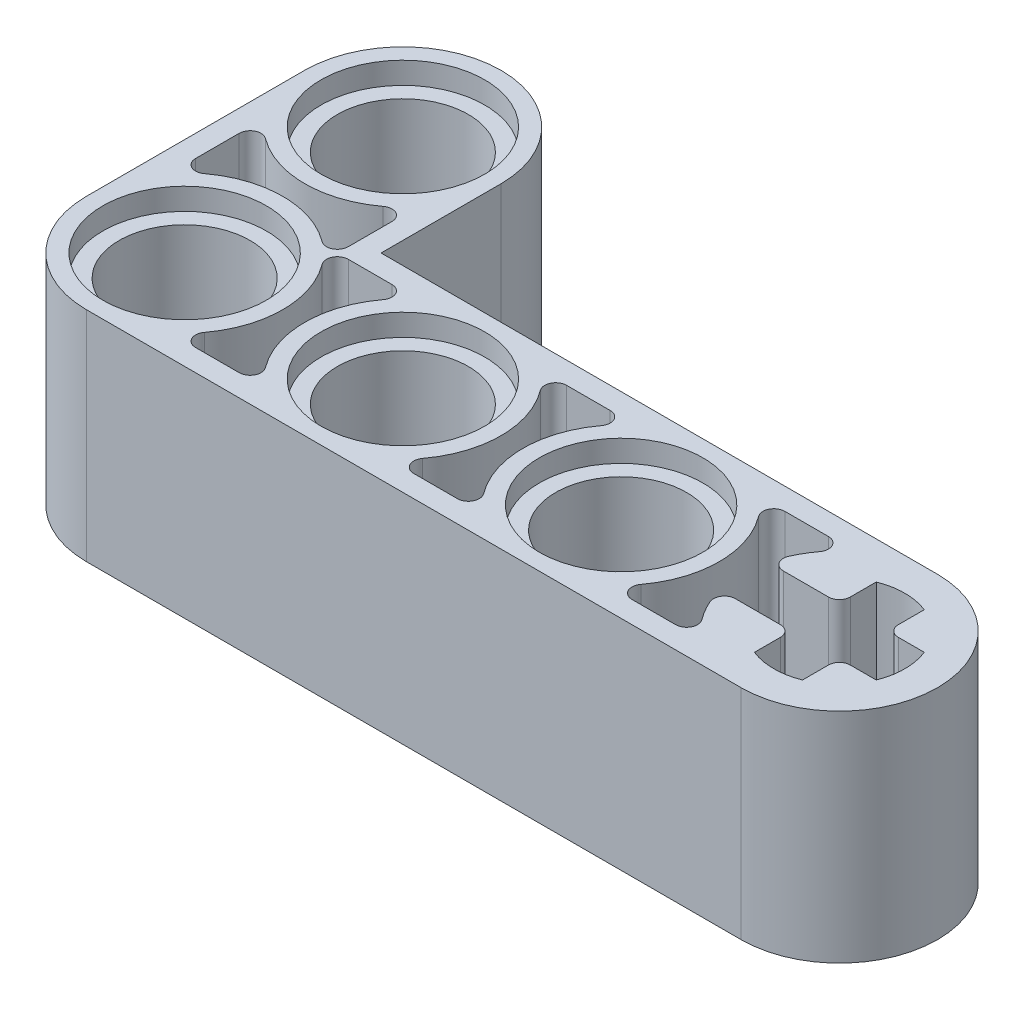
from build123d import *

# Parameters (mm, degrees)
BOSS_EXTRUDE1_DEPTH      = 4
BOSS_EXTRUDE1_DEPTH_BACK = 4
SKETCH1_R                = 2.4
SKETCH2_R                = 3
CUT_EXTRUDE1_DEPTH       = 0.8
CUT_EXTRUDE2_START       = -3.2
CUT_EXTRUDE2_DEPTH       = 3.2
CUT_EXTRUDE3_DEPTH       = 22.02189335


with BuildPart() as part:
    # Sketch1 → Boss-Extrude1 (new, two sides: drawn at the far end of the back side and taken through both)
    with BuildSketch(Plane(origin=(0, 0, 0), x_dir=(1, 0, 0), z_dir=(0, 1, 0)).offset(-BOSS_EXTRUDE1_DEPTH_BACK)):
        with BuildLine():
            Line((12, 3.6), (-8.4, 3.6))
            Line((-8.4, 3.6), (-8.4, 8))
            ThreePointArc((-8.4, 8), (-12, 11.6), (-15.6, 8))
            Line((-15.6, 8), (-15.6, 0))
            ThreePointArc((-15.6, 0), (-14.545584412, -2.545584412), (-12, -3.6))
            Line((-12, -3.6), (12, -3.6))
            ThreePointArc((12, -3.6), (15.6, 0), (12, 3.6))
        make_face()
        with Locations(Location((-4, 0, 0), (0, 0, 270))):
            Circle(SKETCH1_R, mode=Mode.SUBTRACT)
        with Locations(Location((4, 0, 0), (0, 0, 270))):
            Circle(SKETCH1_R, mode=Mode.SUBTRACT)
        with Locations(Location((-12, 0, 0), (0, 0, 270))):
            Circle(SKETCH1_R, mode=Mode.SUBTRACT)
        with Locations(Location((-12, 8, 0), (0, 0, 270))):
            Circle(SKETCH1_R, mode=Mode.SUBTRACT)
        with BuildLine():
            Line((11.12, 2.232845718), (11.12, 1.28))
            ThreePointArc((11.12, 1.28), (11.002842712, 0.997157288), (10.72, 0.88))
            Line((10.72, 0.88), (9.767154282, 0.88))
            ThreePointArc((9.767154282, 0.88), (9.6, 0), (9.767154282, -0.88))
            Line((9.767154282, -0.88), (10.72, -0.88))
            ThreePointArc((10.72, -0.88), (11.002842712, -0.997157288), (11.12, -1.28))
            Line((11.12, -1.28), (11.12, -2.232845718))
            ThreePointArc((11.12, -2.232845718), (12, -2.4), (12.88, -2.232845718))
            Line((12.88, -2.232845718), (12.88, -1.28))
            ThreePointArc((12.88, -1.28), (12.997157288, -0.997157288), (13.28, -0.88))
            Line((13.28, -0.88), (14.232845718, -0.88))
            ThreePointArc((14.232845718, -0.88), (14.4, 0), (14.232845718, 0.88))
            Line((14.232845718, 0.88), (13.28, 0.88))
            ThreePointArc((13.28, 0.88), (12.997157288, 0.997157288), (12.88, 1.28))
            Line((12.88, 1.28), (12.88, 2.232845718))
            ThreePointArc((12.88, 2.232845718), (12, 2.4), (11.12, 2.232845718))
        make_face(mode=Mode.SUBTRACT)
    extrude(amount=BOSS_EXTRUDE1_DEPTH + BOSS_EXTRUDE1_DEPTH_BACK)

    # Sketch2 → Cut-Extrude1 (cut)
    with BuildSketch(Plane(origin=(0, 4, 0), x_dir=(1, 0, 0), z_dir=(0, 1, 0))):
        with Locations(Location((-12, 8, 0), (0, 0, 270))):
            Circle(SKETCH2_R)
        with Locations(Location((-12, 0, 0), (0, 0, 270))):
            Circle(SKETCH2_R)
        with Locations(Location((-4, 0, 0), (0, 0, 270))):
            Circle(SKETCH2_R)
        with Locations(Location((4, 0, 0), (0, 0, 270))):
            Circle(SKETCH2_R)
    cut_extrude1 = extrude(amount=-CUT_EXTRUDE1_DEPTH, mode=Mode.SUBTRACT)

    # Mirror1: Cut-Extrude1 across plane
    add(cut_extrude1.mirror(Plane.ZX), mode=Mode.SUBTRACT)

    # Sketch3 → Cut-Extrude2 (cut)
    with BuildSketch(Plane(origin=(0, 4, 0), x_dir=(1, 0, 0), z_dir=(0, 1, 0)).offset(CUT_EXTRUDE2_START)):
        with BuildLine():
            Line((-0.8, 2.8), (0.8, 2.8))
            ThreePointArc((0.8, 2.8), (1.157770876, 2.578885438), (1.12, 2.16))
            ThreePointArc((1.12, 2.16), (0.4, 0), (1.12, -2.16))
            ThreePointArc((1.12, -2.16), (1.157770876, -2.578885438), (0.8, -2.8))
            Line((0.8, -2.8), (-0.8, -2.8))
            ThreePointArc((-0.8, -2.8), (-1.157770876, -2.578885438), (-1.12, -2.16))
            ThreePointArc((-1.12, -2.16), (-0.4, 0), (-1.12, 2.16))
            ThreePointArc((-1.12, 2.16), (-1.157770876, 2.578885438), (-0.8, 2.8))
        make_face()
        with BuildLine():
            Line((-8.8, 2.8), (-7.2, 2.8))
            ThreePointArc((-7.2, 2.8), (-6.842229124, 2.578885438), (-6.88, 2.16))
            ThreePointArc((-6.88, 2.16), (-7.6, 0), (-6.88, -2.16))
            ThreePointArc((-6.88, -2.16), (-6.842229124, -2.578885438), (-7.2, -2.8))
            Line((-7.2, -2.8), (-8.8, -2.8))
            ThreePointArc((-8.8, -2.8), (-9.157770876, -2.578885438), (-9.12, -2.16))
            ThreePointArc((-9.12, -2.16), (-8.4, 0), (-9.12, 2.16))
            ThreePointArc((-9.12, 2.16), (-9.157770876, 2.578885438), (-8.8, 2.8))
        make_face()
        with BuildLine():
            Line((-14.8, 3.2), (-14.8, 4.8))
            ThreePointArc((-14.8, 4.8), (-14.578885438, 5.157770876), (-14.16, 5.12))
            ThreePointArc((-14.16, 5.12), (-12, 4.4), (-9.84, 5.12))
            ThreePointArc((-9.84, 5.12), (-9.421114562, 5.157770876), (-9.2, 4.8))
            Line((-9.2, 4.8), (-9.2, 3.2))
            ThreePointArc((-9.2, 3.2), (-9.421114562, 2.842229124), (-9.84, 2.88))
            ThreePointArc((-9.84, 2.88), (-12, 3.6), (-14.16, 2.88))
            ThreePointArc((-14.16, 2.88), (-14.578885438, 2.842229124), (-14.8, 3.2))
        make_face()
    cut_extrude2 = extrude(amount=CUT_EXTRUDE2_DEPTH, mode=Mode.SUBTRACT)

    # Mirror2: Cut-Extrude2 across plane
    add(cut_extrude2.mirror(Plane.ZX), mode=Mode.SUBTRACT)

    # Sketch4 → Cut-Extrude3 (cut, through all)
    with BuildSketch(Plane(origin=(0, 4, 0), x_dir=(1, 0, 0), z_dir=(0, 1, 0))):
        with BuildLine():
            Line((7.2, 2.8), (8.8, 2.8))
            ThreePointArc((8.8, 2.8), (9.157770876, 2.578885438), (9.12, 2.16))
            ThreePointArc((9.12, 2.16), (8.889370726, 1.812177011), (8.7005455, 1.44))
            ThreePointArc((8.7005455, 1.44), (8.732487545, 1.060910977), (9.067151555, 0.88))
            Line((9.067151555, 0.88), (9.767154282, 0.88))
            Line((9.767154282, 0.88), (9.767154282, -0.88))
            Line((9.767154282, -0.88), (9.067151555, -0.88))
            ThreePointArc((9.067151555, -0.88), (8.732487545, -1.060910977), (8.7005455, -1.44))
            ThreePointArc((8.7005455, -1.44), (8.889370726, -1.812177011), (9.12, -2.16))
            ThreePointArc((9.12, -2.16), (9.157770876, -2.578885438), (8.8, -2.8))
            Line((8.8, -2.8), (7.2, -2.8))
            ThreePointArc((7.2, -2.8), (6.842229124, -2.578885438), (6.88, -2.16))
            ThreePointArc((6.88, -2.16), (7.6, 0), (6.88, 2.16))
            ThreePointArc((6.88, 2.16), (6.842229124, 2.578885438), (7.2, 2.8))
        make_face()
    extrude(amount=-CUT_EXTRUDE3_DEPTH, mode=Mode.SUBTRACT)


solid = part.part
